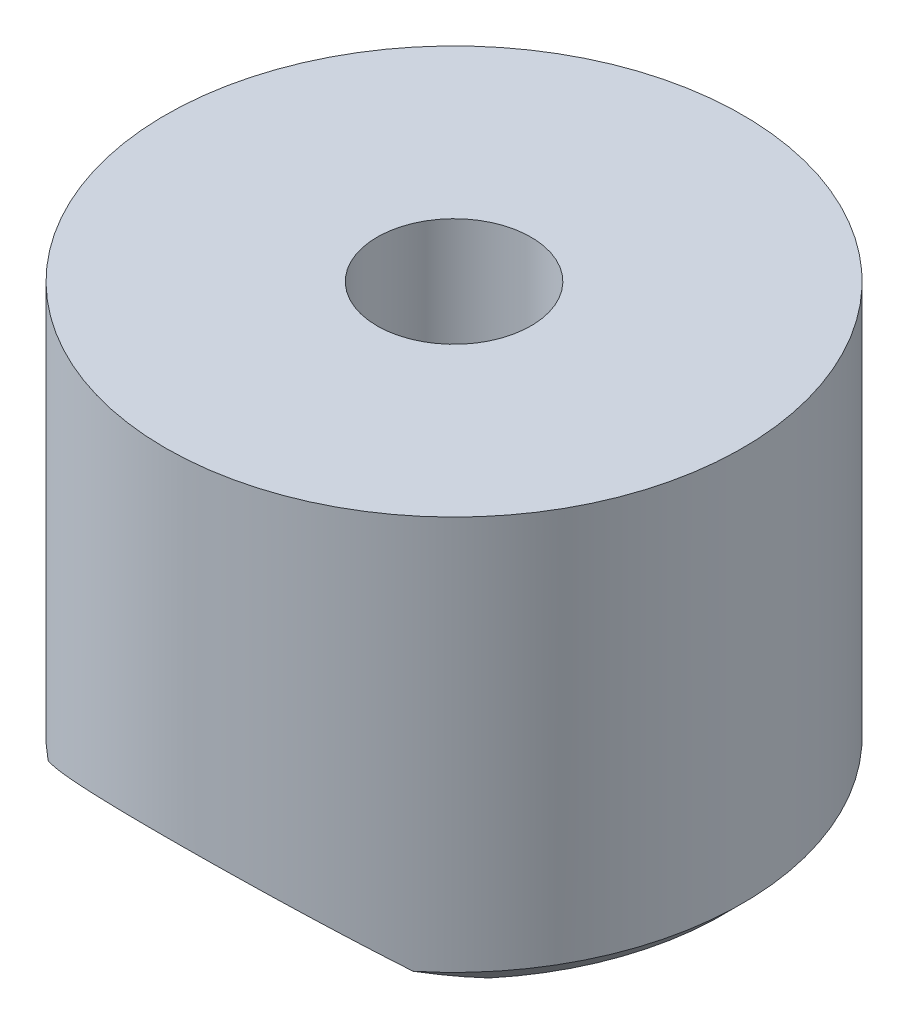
ISO-10303-21;
HEADER;
FILE_DESCRIPTION(('STEP AP214'),'2;1');
FILE_NAME('part.step','',(''),(''),'','','');
FILE_SCHEMA(('AUTOMOTIVE_DESIGN { 1 0 10303 214 1 1 1 1 }'));
ENDSEC;
DATA;
#1=APPLICATION_CONTEXT('core data for automotive mechanical design processes');
#2=APPLICATION_PROTOCOL_DEFINITION('international standard','automotive_design',2000,#1);
#3=PRODUCT_CONTEXT('',#1,'mechanical');
#4=PRODUCT('Part','Part','',(#3));
#5=PRODUCT_RELATED_PRODUCT_CATEGORY('part','',(#4));
#6=PRODUCT_DEFINITION_FORMATION('','',#4);
#7=PRODUCT_DEFINITION_CONTEXT('part definition',#1,'design');
#8=PRODUCT_DEFINITION('design','',#6,#7);
#9=PRODUCT_DEFINITION_SHAPE('','',#8);
#10=(LENGTH_UNIT() NAMED_UNIT(*) SI_UNIT(.MILLI.,.METRE.));
#11=(NAMED_UNIT(*) PLANE_ANGLE_UNIT() SI_UNIT($,.RADIAN.));
#12=(NAMED_UNIT(*) SI_UNIT($,.STERADIAN.) SOLID_ANGLE_UNIT());
#13=UNCERTAINTY_MEASURE_WITH_UNIT(LENGTH_MEASURE(1.E-05),#10,'distance_accuracy_value','');
#14=(GEOMETRIC_REPRESENTATION_CONTEXT(3) GLOBAL_UNCERTAINTY_ASSIGNED_CONTEXT((#13)) GLOBAL_UNIT_ASSIGNED_CONTEXT((#10,
#11,#12)) REPRESENTATION_CONTEXT('',''));
#15=CARTESIAN_POINT('',(0.,0.,0.));
#16=DIRECTION('',(0.,0.,1.));
#17=DIRECTION('',(1.,0.,0.));
#18=AXIS2_PLACEMENT_3D('',#15,#16,#17);
#19=CARTESIAN_POINT('',(0.,-4.,0.));
#20=DIRECTION('',(0.,1.,0.));
#21=DIRECTION('',(0.,0.,1.));
#22=AXIS2_PLACEMENT_3D('',#19,#20,#21);
#23=PLANE('',#22);
#24=DIRECTION('',(0.,0.,1.));
#25=VECTOR('',#24,1.);
#26=CARTESIAN_POINT('',(-10.770329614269,-4.,-15.));
#27=LINE('',#26,#25);
#28=CARTESIAN_POINT('',(-10.770329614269,-4.,-8.94427190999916));
#29=VERTEX_POINT('',#28);
#30=CARTESIAN_POINT('',(-10.770329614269,-4.,8.94427190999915));
#31=VERTEX_POINT('',#30);
#32=EDGE_CURVE('E79',#29,#31,#27,.T.);
#33=ORIENTED_EDGE('',*,*,#32,.T.);
#34=CARTESIAN_POINT('',(0.,-4.,0.));
#35=DIRECTION('',(0.,1.,0.));
#36=DIRECTION('',(0.,0.,1.));
#37=AXIS2_PLACEMENT_3D('',#34,#35,#36);
#38=CIRCLE('',#37,14.);
#39=EDGE_CURVE('E42',#31,#29,#38,.F.);
#40=ORIENTED_EDGE('',*,*,#39,.T.);
#41=EDGE_LOOP('',(#33,#40));
#42=FACE_BOUND('',#41,.T.);
#43=ADVANCED_FACE('F33',(#42),#23,.F.);
#44=CARTESIAN_POINT('',(0.,-4.,0.));
#45=DIRECTION('',(0.,1.,0.));
#46=DIRECTION('',(0.,0.,1.));
#47=AXIS2_PLACEMENT_3D('',#44,#45,#46);
#48=CYLINDRICAL_SURFACE('',#47,15.);
#49=CARTESIAN_POINT('',(-10.770329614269,-4.,-10.4403065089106));
#50=CARTESIAN_POINT('',(-10.5094154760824,-3.77517746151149,-10.7094196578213));
#51=CARTESIAN_POINT('',(-10.236637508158,-3.55439384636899,-10.9706769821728));
#52=CARTESIAN_POINT('',(-9.66680333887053,-3.12350436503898,-11.4759941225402));
#53=CARTESIAN_POINT('',(-9.36971182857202,-2.91341477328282,-11.7200279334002));
#54=CARTESIAN_POINT('',(-8.7488893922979,-2.50549932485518,-12.1905617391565));
#55=CARTESIAN_POINT('',(-8.42495671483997,-2.30779053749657,-12.4168982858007));
#56=CARTESIAN_POINT('',(-7.75307466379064,-1.92988513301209,-12.8471334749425));
#57=CARTESIAN_POINT('',(-7.40513937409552,-1.74967839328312,-13.0510450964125));
#58=CARTESIAN_POINT('',(-6.7545190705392,-1.44244014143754,-13.3972079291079));
#59=CARTESIAN_POINT('',(-6.45583780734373,-1.31181801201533,-13.5438059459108));
#60=CARTESIAN_POINT('',(-5.84401832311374,-1.06607332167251,-13.8188243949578));
#61=CARTESIAN_POINT('',(-5.53088032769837,-0.950950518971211,-13.947245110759));
#62=CARTESIAN_POINT('',(-4.89236544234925,-0.738413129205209,-14.1838044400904));
#63=CARTESIAN_POINT('',(-4.56702868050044,-0.640945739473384,-14.2920035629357));
#64=CARTESIAN_POINT('',(-3.90492495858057,-0.465073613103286,-14.4869123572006));
#65=CARTESIAN_POINT('',(-3.56815815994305,-0.386668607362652,-14.5736223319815));
#66=CARTESIAN_POINT('',(-2.88256779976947,-0.249954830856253,-14.7246394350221));
#67=CARTESIAN_POINT('',(-2.5336675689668,-0.191817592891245,-14.7887553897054));
#68=CARTESIAN_POINT('',(-1.82922762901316,-0.0978607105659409,-14.8923016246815));
#69=CARTESIAN_POINT('',(-1.47368784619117,-0.0620413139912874,-14.9317316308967));
#70=CARTESIAN_POINT('',(-0.759014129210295,-0.0135749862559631,-14.9850703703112));
#71=CARTESIAN_POINT('',(-0.399879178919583,-0.000934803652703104,-14.9989716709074));
#72=CARTESIAN_POINT('',(0.318498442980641,0.0008344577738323,-15.0009179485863));
#73=CARTESIAN_POINT('',(0.677741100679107,-0.0100341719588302,-14.9889654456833));
#74=CARTESIAN_POINT('',(1.35102118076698,-0.0523601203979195,-14.9423872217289));
#75=CARTESIAN_POINT('',(1.66542253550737,-0.0812553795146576,-14.9105827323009));
#76=CARTESIAN_POINT('',(2.28949380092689,-0.156592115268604,-14.8275852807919));
#77=CARTESIAN_POINT('',(2.59916414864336,-0.203031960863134,-14.776394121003));
#78=CARTESIAN_POINT('',(3.21170275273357,-0.312605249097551,-14.6554564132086));
#79=CARTESIAN_POINT('',(3.51457359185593,-0.375732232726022,-14.5857170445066));
#80=CARTESIAN_POINT('',(4.11197242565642,-0.517636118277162,-14.4286896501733));
#81=CARTESIAN_POINT('',(4.40650002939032,-0.59641375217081,-14.3414008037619));
#82=CARTESIAN_POINT('',(4.99556221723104,-0.771303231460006,-14.1472167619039));
#83=CARTESIAN_POINT('',(5.28976511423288,-0.867908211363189,-14.0397617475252));
#84=CARTESIAN_POINT('',(5.86673537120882,-1.07516829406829,-13.8086223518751));
#85=CARTESIAN_POINT('',(6.14949802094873,-1.1858291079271,-13.6849313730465));
#86=CARTESIAN_POINT('',(6.70300901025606,-1.4198776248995,-13.4225041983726));
#87=CARTESIAN_POINT('',(6.97374028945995,-1.54328262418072,-13.2837475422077));
#88=CARTESIAN_POINT('',(7.50224276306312,-1.80126400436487,-12.9925900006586));
#89=CARTESIAN_POINT('',(7.76001249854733,-1.93584163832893,-12.8401875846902));
#90=CARTESIAN_POINT('',(8.27017194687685,-2.21917146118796,-12.5179131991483));
#91=CARTESIAN_POINT('',(8.52213402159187,-2.36823724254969,-12.3476412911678));
#92=CARTESIAN_POINT('',(9.01175139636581,-2.6753169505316,-11.9949728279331));
#93=CARTESIAN_POINT('',(9.24940448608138,-2.83333225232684,-11.8125744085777));
#94=CARTESIAN_POINT('',(9.70916517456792,-3.15606541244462,-11.4376436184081));
#95=CARTESIAN_POINT('',(9.93134586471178,-3.32074498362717,-11.2451676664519));
#96=CARTESIAN_POINT('',(10.3614604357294,-3.65614965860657,-10.8501262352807));
#97=CARTESIAN_POINT('',(10.5694017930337,-3.82687151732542,-10.6475661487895));
#98=CARTESIAN_POINT('',(10.770329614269,-4.,-10.4403065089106));
#99=B_SPLINE_CURVE_WITH_KNOTS('',3,(#49,#50,#51,#52,#53,#54,#55,#56,#57,#58,#59,#60,#61,#62,#63,
#64,#65,#66,#67,#68,#69,#70,#71,#72,#73,#74,#75,#76,#77,#78,#79,#80,#81,#82,#83,#84,#85,#86,#87,
#88,#89,#90,#91,#92,#93,#94,#95,#96,#97,#98),.UNSPECIFIED.,.F.,.F.,(4,2,2,2,2,2,2,2,2,2,2,2,2,2,
2,2,2,2,2,2,2,2,2,2,4),(0.,1.31125754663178,2.62445433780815,3.9486179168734,5.27201102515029,
6.34333913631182,7.41465053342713,8.482703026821,9.55074044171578,10.6276092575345,
11.7044900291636,12.7816842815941,13.8587735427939,14.8096383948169,15.7604148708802,
16.7108238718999,17.6612773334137,18.6436377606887,19.6263986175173,20.6105112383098,
21.5947343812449,22.6100694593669,23.6255609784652,24.6358742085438,25.6456528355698),.UNSPECIFIED.);
#100=CARTESIAN_POINT('',(-9.48683298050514,-3.,-11.6189500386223));
#101=VERTEX_POINT('',#100);
#102=CARTESIAN_POINT('',(9.48683298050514,-3.,-11.6189500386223));
#103=VERTEX_POINT('',#102);
#104=EDGE_CURVE('E77',#101,#103,#99,.T.);
#105=ORIENTED_EDGE('',*,*,#104,.F.);
#106=CARTESIAN_POINT('',(0.,-3.,0.));
#107=DIRECTION('',(0.,1.,0.));
#108=DIRECTION('',(0.,0.,1.));
#109=AXIS2_PLACEMENT_3D('',#106,#107,#108);
#110=CIRCLE('',#109,15.);
#111=CARTESIAN_POINT('',(-9.48683298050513,-3.,11.6189500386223));
#112=VERTEX_POINT('',#111);
#113=EDGE_CURVE('E91',#101,#112,#110,.T.);
#114=ORIENTED_EDGE('',*,*,#113,.T.);
#115=CARTESIAN_POINT('',(10.770329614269,-4.,10.4403065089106));
#116=CARTESIAN_POINT('',(10.5094154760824,-3.77517746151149,10.7094196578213));
#117=CARTESIAN_POINT('',(10.236637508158,-3.55439384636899,10.9706769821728));
#118=CARTESIAN_POINT('',(9.66680333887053,-3.12350436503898,11.4759941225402));
#119=CARTESIAN_POINT('',(9.36971182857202,-2.91341477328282,11.7200279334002));
#120=CARTESIAN_POINT('',(8.7488893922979,-2.50549932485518,12.1905617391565));
#121=CARTESIAN_POINT('',(8.42495671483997,-2.30779053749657,12.4168982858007));
#122=CARTESIAN_POINT('',(7.75307466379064,-1.92988513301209,12.8471334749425));
#123=CARTESIAN_POINT('',(7.40513937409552,-1.74967839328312,13.0510450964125));
#124=CARTESIAN_POINT('',(6.75451907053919,-1.44244014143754,13.3972079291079));
#125=CARTESIAN_POINT('',(6.45583780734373,-1.31181801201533,13.5438059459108));
#126=CARTESIAN_POINT('',(5.84401832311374,-1.06607332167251,13.8188243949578));
#127=CARTESIAN_POINT('',(5.53088032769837,-0.950950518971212,13.947245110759));
#128=CARTESIAN_POINT('',(4.89236544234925,-0.738413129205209,14.1838044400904));
#129=CARTESIAN_POINT('',(4.56702868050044,-0.640945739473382,14.2920035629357));
#130=CARTESIAN_POINT('',(3.90492495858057,-0.465073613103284,14.4869123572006));
#131=CARTESIAN_POINT('',(3.56815815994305,-0.386668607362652,14.5736223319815));
#132=CARTESIAN_POINT('',(2.88256779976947,-0.249954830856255,14.7246394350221));
#133=CARTESIAN_POINT('',(2.5336675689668,-0.191817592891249,14.7887553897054));
#134=CARTESIAN_POINT('',(1.82922762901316,-0.0978607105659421,14.8923016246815));
#135=CARTESIAN_POINT('',(1.47368784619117,-0.0620413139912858,14.9317316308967));
#136=CARTESIAN_POINT('',(0.759014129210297,-0.0135749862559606,14.9850703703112));
#137=CARTESIAN_POINT('',(0.399879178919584,-0.000934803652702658,14.9989716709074));
#138=CARTESIAN_POINT('',(-0.31849844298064,0.000834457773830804,15.0009179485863));
#139=CARTESIAN_POINT('',(-0.677741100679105,-0.0100341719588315,14.9889654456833));
#140=CARTESIAN_POINT('',(-1.35102118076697,-0.0523601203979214,14.9423872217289));
#141=CARTESIAN_POINT('',(-1.66542253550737,-0.0812553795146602,14.9105827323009));
#142=CARTESIAN_POINT('',(-2.28949380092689,-0.156592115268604,14.8275852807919));
#143=CARTESIAN_POINT('',(-2.59916414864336,-0.203031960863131,14.776394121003));
#144=CARTESIAN_POINT('',(-3.21170275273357,-0.312605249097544,14.6554564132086));
#145=CARTESIAN_POINT('',(-3.51457359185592,-0.375732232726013,14.5857170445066));
#146=CARTESIAN_POINT('',(-4.11197242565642,-0.517636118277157,14.4286896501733));
#147=CARTESIAN_POINT('',(-4.40650002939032,-0.59641375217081,14.3414008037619));
#148=CARTESIAN_POINT('',(-4.99556221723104,-0.771303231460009,14.1472167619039));
#149=CARTESIAN_POINT('',(-5.28976511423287,-0.867908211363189,14.0397617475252));
#150=CARTESIAN_POINT('',(-5.86673537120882,-1.07516829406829,13.8086223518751));
#151=CARTESIAN_POINT('',(-6.14949802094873,-1.1858291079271,13.6849313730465));
#152=CARTESIAN_POINT('',(-6.70300901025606,-1.4198776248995,13.4225041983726));
#153=CARTESIAN_POINT('',(-6.97374028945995,-1.54328262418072,13.2837475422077));
#154=CARTESIAN_POINT('',(-7.50224276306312,-1.80126400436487,12.9925900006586));
#155=CARTESIAN_POINT('',(-7.76001249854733,-1.93584163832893,12.8401875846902));
#156=CARTESIAN_POINT('',(-8.27017194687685,-2.21917146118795,12.5179131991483));
#157=CARTESIAN_POINT('',(-8.52213402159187,-2.36823724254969,12.3476412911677));
#158=CARTESIAN_POINT('',(-9.0117513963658,-2.67531695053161,11.9949728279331));
#159=CARTESIAN_POINT('',(-9.24940448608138,-2.83333225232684,11.8125744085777));
#160=CARTESIAN_POINT('',(-9.70916517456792,-3.15606541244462,11.4376436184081));
#161=CARTESIAN_POINT('',(-9.93134586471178,-3.32074498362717,11.2451676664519));
#162=CARTESIAN_POINT('',(-10.3614604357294,-3.65614965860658,10.8501262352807));
#163=CARTESIAN_POINT('',(-10.5694017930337,-3.82687151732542,10.6475661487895));
#164=CARTESIAN_POINT('',(-10.770329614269,-4.,10.4403065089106));
#165=B_SPLINE_CURVE_WITH_KNOTS('',3,(#115,#116,#117,#118,#119,#120,#121,#122,#123,#124,#125,
#126,#127,#128,#129,#130,#131,#132,#133,#134,#135,#136,#137,#138,#139,#140,#141,#142,#143,#144,
#145,#146,#147,#148,#149,#150,#151,#152,#153,#154,#155,#156,#157,#158,#159,#160,#161,#162,#163,
#164),.UNSPECIFIED.,.F.,.F.,(4,2,2,2,2,2,2,2,2,2,2,2,2,2,2,2,2,2,2,2,2,2,2,2,4),(0.,
1.31125754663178,2.62445433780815,3.9486179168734,5.27201102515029,6.34333913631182,
7.41465053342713,8.482703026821,9.55074044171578,10.6276092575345,11.7044900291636,
12.7816842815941,13.8587735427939,14.8096383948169,15.7604148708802,16.7108238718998,
17.6612773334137,18.6436377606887,19.6263986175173,20.6105112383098,21.5947343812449,
22.6100694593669,23.6255609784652,24.6358742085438,25.6456528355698),.UNSPECIFIED.);
#166=CARTESIAN_POINT('',(9.48683298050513,-3.,11.6189500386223));
#167=VERTEX_POINT('',#166);
#168=EDGE_CURVE('E129',#167,#112,#165,.T.);
#169=ORIENTED_EDGE('',*,*,#168,.F.);
#170=CARTESIAN_POINT('',(0.,-3.,0.));
#171=DIRECTION('',(0.,1.,0.));
#172=DIRECTION('',(0.,0.,1.));
#173=AXIS2_PLACEMENT_3D('',#170,#171,#172);
#174=CIRCLE('',#173,15.);
#175=EDGE_CURVE('E93',#167,#103,#174,.T.);
#176=ORIENTED_EDGE('',*,*,#175,.T.);
#177=EDGE_LOOP('',(#105,#114,#169,#176));
#178=FACE_BOUND('',#177,.T.);
#179=CARTESIAN_POINT('',(0.,17.5,0.));
#180=DIRECTION('',(0.,1.,0.));
#181=DIRECTION('',(0.,0.,1.));
#182=AXIS2_PLACEMENT_3D('',#179,#180,#181);
#183=CIRCLE('',#182,15.);
#184=CARTESIAN_POINT('',(0.,17.5,15.));
#185=VERTEX_POINT('',#184);
#186=EDGE_CURVE('E100',#185,#185,#183,.T.);
#187=ORIENTED_EDGE('',*,*,#186,.F.);
#188=EDGE_LOOP('',(#187));
#189=FACE_BOUND('',#188,.T.);
#190=ADVANCED_FACE('F88',(#178,#189),#48,.T.);
#191=DIRECTION('',(0.,0.,1.));
#192=VECTOR('',#191,1.);
#193=CARTESIAN_POINT('',(10.770329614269,-4.,-15.));
#194=LINE('',#193,#192);
#195=CARTESIAN_POINT('',(10.770329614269,-4.,8.94427190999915));
#196=VERTEX_POINT('',#195);
#197=CARTESIAN_POINT('',(10.770329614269,-4.,-8.94427190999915));
#198=VERTEX_POINT('',#197);
#199=EDGE_CURVE('E94',#196,#198,#194,.F.);
#200=ORIENTED_EDGE('',*,*,#199,.T.);
#201=CARTESIAN_POINT('',(0.,-4.,0.));
#202=DIRECTION('',(0.,1.,0.));
#203=DIRECTION('',(0.,0.,1.));
#204=AXIS2_PLACEMENT_3D('',#201,#202,#203);
#205=CIRCLE('',#204,14.);
#206=EDGE_CURVE('E11',#198,#196,#205,.F.);
#207=ORIENTED_EDGE('',*,*,#206,.T.);
#208=EDGE_LOOP('',(#200,#207));
#209=FACE_BOUND('',#208,.T.);
#210=ADVANCED_FACE('F157',(#209),#23,.F.);
#211=CARTESIAN_POINT('',(0.,-4.,0.));
#212=DIRECTION('',(0.,1.,0.));
#213=DIRECTION('',(0.,0.,1.));
#214=AXIS2_PLACEMENT_3D('',#211,#212,#213);
#215=CYLINDRICAL_SURFACE('',#214,4.);
#216=CARTESIAN_POINT('',(0.,0.,4.));
#217=CARTESIAN_POINT('',(-0.221217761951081,-3.86905930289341E-06,3.99999341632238));
#218=CARTESIAN_POINT('',(-0.442510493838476,-0.00449339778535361,3.98158670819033));
#219=CARTESIAN_POINT('',(-0.87876796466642,-0.0219683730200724,3.90854784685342));
#220=CARTESIAN_POINT('',(-1.09372879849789,-0.0349589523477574,3.85389380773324));
#221=CARTESIAN_POINT('',(-1.51095830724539,-0.0679955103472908,3.71020595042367));
#222=CARTESIAN_POINT('',(-1.71324141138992,-0.08803328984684,3.6212120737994));
#223=CARTESIAN_POINT('',(-2.10000524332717,-0.133023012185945,3.41150788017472));
#224=CARTESIAN_POINT('',(-2.28448563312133,-0.157975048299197,3.29079696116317));
#225=CARTESIAN_POINT('',(-2.63399745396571,-0.210620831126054,3.01860385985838));
#226=CARTESIAN_POINT('',(-2.79863318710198,-0.238354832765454,2.86662133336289));
#227=CARTESIAN_POINT('',(-3.1003451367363,-0.293167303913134,2.53727122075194));
#228=CARTESIAN_POINT('',(-3.23741841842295,-0.320245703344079,2.35990093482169));
#229=CARTESIAN_POINT('',(-3.48194608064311,-0.371084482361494,1.98177500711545));
#230=CARTESIAN_POINT('',(-3.58896325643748,-0.39479362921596,1.7807291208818));
#231=CARTESIAN_POINT('',(-3.76753114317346,-0.435624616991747,1.36283416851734));
#232=CARTESIAN_POINT('',(-3.83908715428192,-0.452747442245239,1.1459874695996));
#233=CARTESIAN_POINT('',(-3.94336223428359,-0.478054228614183,0.706983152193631));
#234=CARTESIAN_POINT('',(-3.9767900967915,-0.486401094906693,0.485003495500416));
#235=CARTESIAN_POINT('',(-4.00606683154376,-0.49369891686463,0.0384420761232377));
#236=CARTESIAN_POINT('',(-4.00192143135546,-0.492651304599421,-0.186139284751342));
#237=CARTESIAN_POINT('',(-3.95673605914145,-0.481425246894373,-0.626138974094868));
#238=CARTESIAN_POINT('',(-3.91653519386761,-0.471454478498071,-0.841649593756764));
#239=CARTESIAN_POINT('',(-3.80171627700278,-0.443835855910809,-1.26277294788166));
#240=CARTESIAN_POINT('',(-3.72709590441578,-0.42618748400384,-1.46838501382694));
#241=CARTESIAN_POINT('',(-3.54482722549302,-0.385008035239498,-1.86615220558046));
#242=CARTESIAN_POINT('',(-3.43686983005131,-0.361422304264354,-2.05815980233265));
#243=CARTESIAN_POINT('',(-3.19120806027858,-0.311057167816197,-2.42163745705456));
#244=CARTESIAN_POINT('',(-3.05349876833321,-0.284277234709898,-2.59310411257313));
#245=CARTESIAN_POINT('',(-2.74787153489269,-0.229662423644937,-2.91544710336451));
#246=CARTESIAN_POINT('',(-2.57924406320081,-0.201818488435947,-3.06564996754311));
#247=CARTESIAN_POINT('',(-2.21886395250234,-0.14886054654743,-3.33576858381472));
#248=CARTESIAN_POINT('',(-2.02711068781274,-0.12374661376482,-3.45568351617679));
#249=CARTESIAN_POINT('',(-1.62499664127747,-0.0789652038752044,-3.66204873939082));
#250=CARTESIAN_POINT('',(-1.4145804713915,-0.0593147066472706,-3.74839502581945));
#251=CARTESIAN_POINT('',(-0.981638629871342,-0.0277982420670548,-3.88430659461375));
#252=CARTESIAN_POINT('',(-0.759115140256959,-0.0159308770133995,-3.93387848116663));
#253=CARTESIAN_POINT('',(-0.314038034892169,-0.00152265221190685,-3.99381803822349));
#254=CARTESIAN_POINT('',(-0.0916149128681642,0.00123650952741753,-4.00510352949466));
#255=CARTESIAN_POINT('',(0.351940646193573,-0.00226333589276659,-3.99065975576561));
#256=CARTESIAN_POINT('',(0.573073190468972,-0.00852158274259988,-3.96493361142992));
#257=CARTESIAN_POINT('',(1.00461868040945,-0.0292136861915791,-3.87795471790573));
#258=CARTESIAN_POINT('',(1.21513752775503,-0.0435333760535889,-3.81719779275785));
#259=CARTESIAN_POINT('',(1.62298766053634,-0.0787379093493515,-3.66244427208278));
#260=CARTESIAN_POINT('',(1.82031765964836,-0.0996233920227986,-3.56844443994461));
#261=CARTESIAN_POINT('',(2.19987701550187,-0.146170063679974,-3.34806106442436));
#262=CARTESIAN_POINT('',(2.38179479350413,-0.171906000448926,-3.22115705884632));
#263=CARTESIAN_POINT('',(2.72207962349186,-0.22517287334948,-2.93923789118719));
#264=CARTESIAN_POINT('',(2.88044285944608,-0.252704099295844,-2.78421818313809));
#265=CARTESIAN_POINT('',(3.1728673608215,-0.307236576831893,-2.44621780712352));
#266=CARTESIAN_POINT('',(3.30628668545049,-0.334211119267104,-2.26267655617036));
#267=CARTESIAN_POINT('',(3.5404244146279,-0.383865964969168,-1.87526340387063));
#268=CARTESIAN_POINT('',(3.64114428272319,-0.406546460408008,-1.67139241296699));
#269=CARTESIAN_POINT('',(3.80628546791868,-0.444802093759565,-1.25021537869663));
#270=CARTESIAN_POINT('',(3.87092136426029,-0.46041912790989,-1.03299747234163));
#271=CARTESIAN_POINT('',(3.96264474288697,-0.482830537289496,-0.590345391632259));
#272=CARTESIAN_POINT('',(3.98973985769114,-0.489626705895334,-0.364912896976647));
#273=CARTESIAN_POINT('',(4.0052319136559,-0.49349607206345,0.0812529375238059));
#274=CARTESIAN_POINT('',(3.99465259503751,-0.490826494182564,0.301949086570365));
#275=CARTESIAN_POINT('',(3.9374253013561,-0.476656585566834,0.73831061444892));
#276=CARTESIAN_POINT('',(3.89077796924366,-0.465156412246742,0.953976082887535));
#277=CARTESIAN_POINT('',(3.76328223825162,-0.434760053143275,1.37311728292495));
#278=CARTESIAN_POINT('',(3.68261498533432,-0.41590307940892,1.57665115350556));
#279=CARTESIAN_POINT('',(3.4895146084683,-0.372910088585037,1.96743647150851));
#280=CARTESIAN_POINT('',(3.37707734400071,-0.348773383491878,2.15468579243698));
#281=CARTESIAN_POINT('',(3.12037219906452,-0.297198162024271,2.51255943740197));
#282=CARTESIAN_POINT('',(2.97538898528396,-0.269693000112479,2.68266113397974));
#283=CARTESIAN_POINT('',(2.65911590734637,-0.214889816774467,2.99645452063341));
#284=CARTESIAN_POINT('',(2.48781985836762,-0.187591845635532,3.1401399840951));
#285=CARTESIAN_POINT('',(2.12032128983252,-0.135733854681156,3.39935916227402));
#286=CARTESIAN_POINT('',(1.9237496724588,-0.111227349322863,3.51438106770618));
#287=CARTESIAN_POINT('',(1.51348978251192,-0.0682701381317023,3.70956418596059));
#288=CARTESIAN_POINT('',(1.29981445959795,-0.0498149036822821,3.78975148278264));
#289=CARTESIAN_POINT('',(0.905298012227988,-0.023913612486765,3.90047067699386));
#290=CARTESIAN_POINT('',(0.726406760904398,-0.0150060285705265,3.93771599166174));
#291=CARTESIAN_POINT('',(0.365027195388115,-0.00304782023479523,3.98748254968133));
#292=CARTESIAN_POINT('',(0.182539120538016,3.19257674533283E-06,4.00000543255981));
#293=CARTESIAN_POINT('',(0.,0.,4.));
#294=B_SPLINE_CURVE_WITH_KNOTS('',3,(#216,#217,#218,#219,#220,#221,#222,#223,#224,#225,#226,
#227,#228,#229,#230,#231,#232,#233,#234,#235,#236,#237,#238,#239,#240,#241,#242,#243,#244,#245,
#246,#247,#248,#249,#250,#251,#252,#253,#254,#255,#256,#257,#258,#259,#260,#261,#262,#263,#264,
#265,#266,#267,#268,#269,#270,#271,#272,#273,#274,#275,#276,#277,#278,#279,#280,#281,#282,#283,
#284,#285,#286,#287,#288,#289,#290,#291,#292,#293),.UNSPECIFIED.,.T.,.F.,(4,2,2,2,2,2,2,2,2,2,2,
2,2,2,2,2,2,2,2,2,2,2,2,2,2,2,2,2,2,2,2,2,2,2,2,2,2,2,4),(0.,0.662984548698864,1.32636976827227,
1.9889857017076,2.65161421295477,3.32580914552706,4.00007582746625,4.68369500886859,
5.36721198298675,6.03780413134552,6.70829405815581,7.36357355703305,8.01889724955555,
8.68048919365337,9.34219057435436,10.0215921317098,10.7010120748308,11.3825205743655,
12.0639066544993,12.7288381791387,13.3937136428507,14.0494017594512,14.7051537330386,
15.3719884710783,16.0389311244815,16.7211970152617,17.4034323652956,18.081566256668,
18.7595622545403,19.4192770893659,20.0789801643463,20.7352140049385,21.391533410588,
22.064006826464,22.7366385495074,23.4205359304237,24.1039203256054,24.6510221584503,
25.1980877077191),.UNSPECIFIED.);
#295=CARTESIAN_POINT('',(0.,0.,4.));
#296=VERTEX_POINT('',#295);
#297=EDGE_CURVE('E120',#296,#296,#294,.T.);
#298=ORIENTED_EDGE('',*,*,#297,.T.);
#299=EDGE_LOOP('',(#298));
#300=FACE_BOUND('',#299,.T.);
#301=CARTESIAN_POINT('',(0.,17.5,0.));
#302=DIRECTION('',(0.,1.,0.));
#303=DIRECTION('',(0.,0.,1.));
#304=AXIS2_PLACEMENT_3D('',#301,#302,#303);
#305=CIRCLE('',#304,4.);
#306=CARTESIAN_POINT('',(0.,17.5,4.));
#307=VERTEX_POINT('',#306);
#308=EDGE_CURVE('E175',#307,#307,#305,.T.);
#309=ORIENTED_EDGE('',*,*,#308,.T.);
#310=EDGE_LOOP('',(#309));
#311=FACE_BOUND('',#310,.T.);
#312=ADVANCED_FACE('F160',(#300,#311),#215,.F.);
#313=CARTESIAN_POINT('',(0.,17.5,0.));
#314=DIRECTION('',(0.,1.,0.));
#315=DIRECTION('',(0.,0.,1.));
#316=AXIS2_PLACEMENT_3D('',#313,#314,#315);
#317=PLANE('',#316);
#318=ORIENTED_EDGE('',*,*,#186,.T.);
#319=EDGE_LOOP('',(#318));
#320=FACE_BOUND('',#319,.T.);
#321=ORIENTED_EDGE('',*,*,#308,.F.);
#322=EDGE_LOOP('',(#321));
#323=FACE_BOUND('',#322,.T.);
#324=ADVANCED_FACE('F116',(#320,#323),#317,.T.);
#325=CARTESIAN_POINT('',(0.,-16.5,-15.));
#326=DIRECTION('',(0.,0.,1.));
#327=DIRECTION('',(1.,0.,0.));
#328=AXIS2_PLACEMENT_3D('',#325,#326,#327);
#329=CYLINDRICAL_SURFACE('',#328,16.5);
#330=ORIENTED_EDGE('',*,*,#168,.T.);
#331=CARTESIAN_POINT('',(-9.48683298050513,-3.,11.6189500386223));
#332=CARTESIAN_POINT('',(-9.61048885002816,-3.08690126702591,11.4057838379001));
#333=CARTESIAN_POINT('',(-9.72984052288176,-3.17330636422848,11.1899326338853));
#334=CARTESIAN_POINT('',(-9.96000067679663,-3.34443252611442,10.7534917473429));
#335=CARTESIAN_POINT('',(-10.0708206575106,-3.42915573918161,10.5329089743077));
#336=CARTESIAN_POINT('',(-10.2843274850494,-3.59647335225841,10.0870355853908));
#337=CARTESIAN_POINT('',(-10.3870138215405,-3.67906761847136,9.86174467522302));
#338=CARTESIAN_POINT('',(-10.5845535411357,-3.84165919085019,9.40642502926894));
#339=CARTESIAN_POINT('',(-10.6793959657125,-3.92165277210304,9.17639020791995));
#340=CARTESIAN_POINT('',(-10.770329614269,-4.,8.94427190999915));
#341=B_SPLINE_CURVE_WITH_KNOTS('',3,(#331,#332,#333,#334,#335,#336,#337,#338,#339,#340),
.UNSPECIFIED.,.F.,.F.,(4,2,2,2,4),(0.,0.783860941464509,1.56664613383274,2.34948040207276,
3.13339049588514),.UNSPECIFIED.);
#342=EDGE_CURVE('E83',#112,#31,#341,.T.);
#343=ORIENTED_EDGE('',*,*,#342,.T.);
#344=ORIENTED_EDGE('',*,*,#32,.F.);
#345=CARTESIAN_POINT('',(-10.770329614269,-4.,-8.94427190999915));
#346=CARTESIAN_POINT('',(-10.6793959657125,-3.92165277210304,-9.17639020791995));
#347=CARTESIAN_POINT('',(-10.5845535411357,-3.8416591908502,-9.40642502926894));
#348=CARTESIAN_POINT('',(-10.3870138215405,-3.67906761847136,-9.86174467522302));
#349=CARTESIAN_POINT('',(-10.2843274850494,-3.5964733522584,-10.0870355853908));
#350=CARTESIAN_POINT('',(-10.0708206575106,-3.42915573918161,-10.5329089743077));
#351=CARTESIAN_POINT('',(-9.96000067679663,-3.34443252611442,-10.7534917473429));
#352=CARTESIAN_POINT('',(-9.72984052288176,-3.17330636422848,-11.1899326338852));
#353=CARTESIAN_POINT('',(-9.61048885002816,-3.08690126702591,-11.4057838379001));
#354=CARTESIAN_POINT('',(-9.48683298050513,-3.,-11.6189500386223));
#355=B_SPLINE_CURVE_WITH_KNOTS('',3,(#345,#346,#347,#348,#349,#350,#351,#352,#353,#354),
.UNSPECIFIED.,.F.,.F.,(4,2,2,2,4),(0.,0.783910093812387,1.56674436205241,2.34952955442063,
3.13339049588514),.UNSPECIFIED.);
#356=EDGE_CURVE('E72',#29,#101,#355,.T.);
#357=ORIENTED_EDGE('',*,*,#356,.T.);
#358=ORIENTED_EDGE('',*,*,#104,.T.);
#359=CARTESIAN_POINT('',(9.48683298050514,-3.,-11.6189500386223));
#360=CARTESIAN_POINT('',(9.61048885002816,-3.08690126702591,-11.4057838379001));
#361=CARTESIAN_POINT('',(9.72984052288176,-3.17330636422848,-11.1899326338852));
#362=CARTESIAN_POINT('',(9.96000067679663,-3.34443252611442,-10.7534917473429));
#363=CARTESIAN_POINT('',(10.0708206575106,-3.42915573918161,-10.5329089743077));
#364=CARTESIAN_POINT('',(10.2843274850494,-3.59647335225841,-10.0870355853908));
#365=CARTESIAN_POINT('',(10.3870138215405,-3.67906761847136,-9.86174467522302));
#366=CARTESIAN_POINT('',(10.5845535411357,-3.84165919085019,-9.40642502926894));
#367=CARTESIAN_POINT('',(10.6793959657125,-3.92165277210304,-9.17639020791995));
#368=CARTESIAN_POINT('',(10.770329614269,-4.,-8.94427190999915));
#369=B_SPLINE_CURVE_WITH_KNOTS('',3,(#359,#360,#361,#362,#363,#364,#365,#366,#367,#368),
.UNSPECIFIED.,.F.,.F.,(4,2,2,2,4),(0.,0.783860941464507,1.56664613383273,2.34948040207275,
3.13339049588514),.UNSPECIFIED.);
#370=EDGE_CURVE('E49',#103,#198,#369,.T.);
#371=ORIENTED_EDGE('',*,*,#370,.T.);
#372=ORIENTED_EDGE('',*,*,#199,.F.);
#373=CARTESIAN_POINT('',(10.770329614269,-4.,8.94427190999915));
#374=CARTESIAN_POINT('',(10.6793959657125,-3.92165277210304,9.17639020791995));
#375=CARTESIAN_POINT('',(10.5845535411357,-3.8416591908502,9.40642502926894));
#376=CARTESIAN_POINT('',(10.3870138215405,-3.67906761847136,9.86174467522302));
#377=CARTESIAN_POINT('',(10.2843274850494,-3.5964733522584,10.0870355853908));
#378=CARTESIAN_POINT('',(10.0708206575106,-3.42915573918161,10.5329089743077));
#379=CARTESIAN_POINT('',(9.96000067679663,-3.34443252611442,10.7534917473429));
#380=CARTESIAN_POINT('',(9.72984052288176,-3.17330636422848,11.1899326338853));
#381=CARTESIAN_POINT('',(9.61048885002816,-3.08690126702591,11.4057838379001));
#382=CARTESIAN_POINT('',(9.48683298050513,-3.,11.6189500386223));
#383=B_SPLINE_CURVE_WITH_KNOTS('',3,(#373,#374,#375,#376,#377,#378,#379,#380,#381,#382),
.UNSPECIFIED.,.F.,.F.,(4,2,2,2,4),(0.,0.783910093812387,1.56674436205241,2.34952955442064,
3.13339049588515),.UNSPECIFIED.);
#384=EDGE_CURVE('E97',#196,#167,#383,.T.);
#385=ORIENTED_EDGE('',*,*,#384,.T.);
#386=EDGE_LOOP('',(#330,#343,#344,#357,#358,#371,#372,#385));
#387=FACE_BOUND('',#386,.T.);
#388=ORIENTED_EDGE('',*,*,#297,.F.);
#389=EDGE_LOOP('',(#388));
#390=FACE_BOUND('',#389,.T.);
#391=ADVANCED_FACE('F75',(#387,#390),#329,.F.);
#392=CARTESIAN_POINT('',(0.,-3.,0.));
#393=DIRECTION('',(0.,1.,0.));
#394=DIRECTION('',(0.,0.,1.));
#395=AXIS2_PLACEMENT_3D('',#392,#393,#394);
#396=CONICAL_SURFACE('',#395,15.,0.78539816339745);
#397=ORIENTED_EDGE('',*,*,#356,.F.);
#398=ORIENTED_EDGE('',*,*,#39,.F.);
#399=ORIENTED_EDGE('',*,*,#342,.F.);
#400=ORIENTED_EDGE('',*,*,#113,.F.);
#401=EDGE_LOOP('',(#397,#398,#399,#400));
#402=FACE_BOUND('',#401,.T.);
#403=ADVANCED_FACE('F96',(#402),#396,.T.);
#404=CARTESIAN_POINT('',(0.,-3.,0.));
#405=DIRECTION('',(0.,1.,0.));
#406=DIRECTION('',(0.,0.,1.));
#407=AXIS2_PLACEMENT_3D('',#404,#405,#406);
#408=CONICAL_SURFACE('',#407,15.,0.78539816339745);
#409=ORIENTED_EDGE('',*,*,#384,.F.);
#410=ORIENTED_EDGE('',*,*,#206,.F.);
#411=ORIENTED_EDGE('',*,*,#370,.F.);
#412=ORIENTED_EDGE('',*,*,#175,.F.);
#413=EDGE_LOOP('',(#409,#410,#411,#412));
#414=FACE_BOUND('',#413,.T.);
#415=ADVANCED_FACE('F35',(#414),#408,.T.);
#416=CLOSED_SHELL('',(#43,#190,#210,#312,#324,#391,#403,#415));
#417=MANIFOLD_SOLID_BREP('B2',#416);
#418=ADVANCED_BREP_SHAPE_REPRESENTATION('',(#18,#417),#14);
#419=SHAPE_DEFINITION_REPRESENTATION(#9,#418);
ENDSEC;
END-ISO-10303-21;
